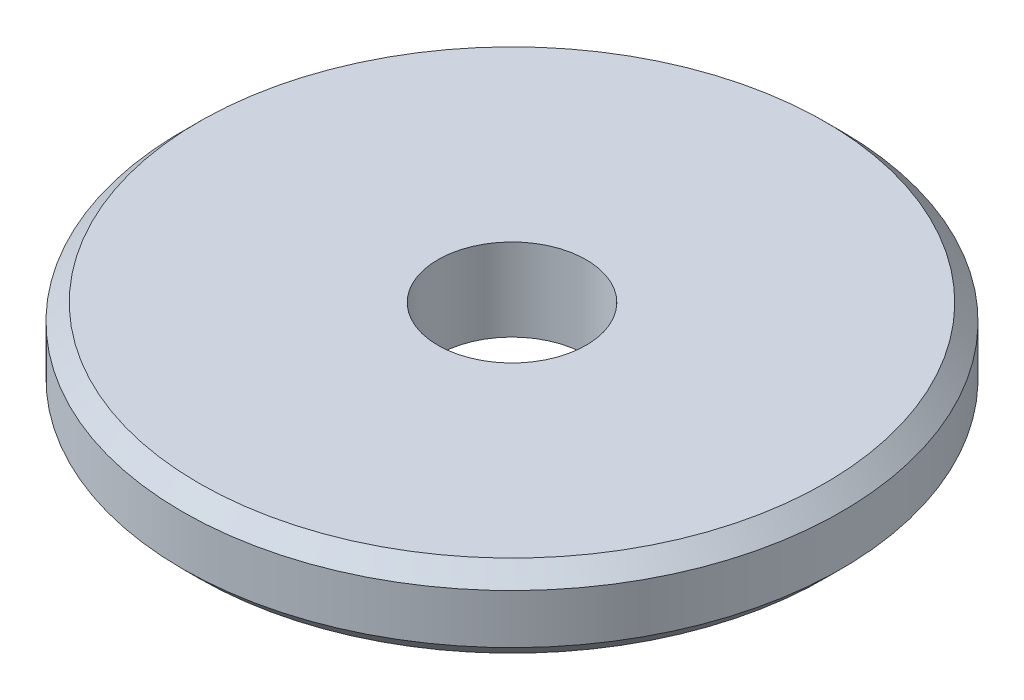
from build123d import *

# Parameters (mm, degrees)
SKETCH1_R      = 20
SKETCH1_R_2    = 4.5
EXTRUDE1_DEPTH = 5
CHAMFER1_SIZE  = 1


with BuildPart() as part:
    # Sketch1 → Extrude1 (new body)
    with BuildSketch(Plane(origin=(0, 0, 0), x_dir=(1, 0, 0), z_dir=(0, 1, 0))):
        with Locations(Location((0, 0, 0), (0, 0, 270))):
            Circle(SKETCH1_R)
        with Locations(Location((0, 0, 0), (0, 0, 270))):
            Circle(SKETCH1_R_2, mode=Mode.SUBTRACT)
    extrude(amount=EXTRUDE1_DEPTH)

    # Chamfer1
    chamfer1_edges = [part.edges().sort_by_distance(p)[0] for p in [
        (0, 0, -20),
        (0, 5, -20),
    ]]
    chamfer(chamfer1_edges, length=CHAMFER1_SIZE)


solid = part.part
